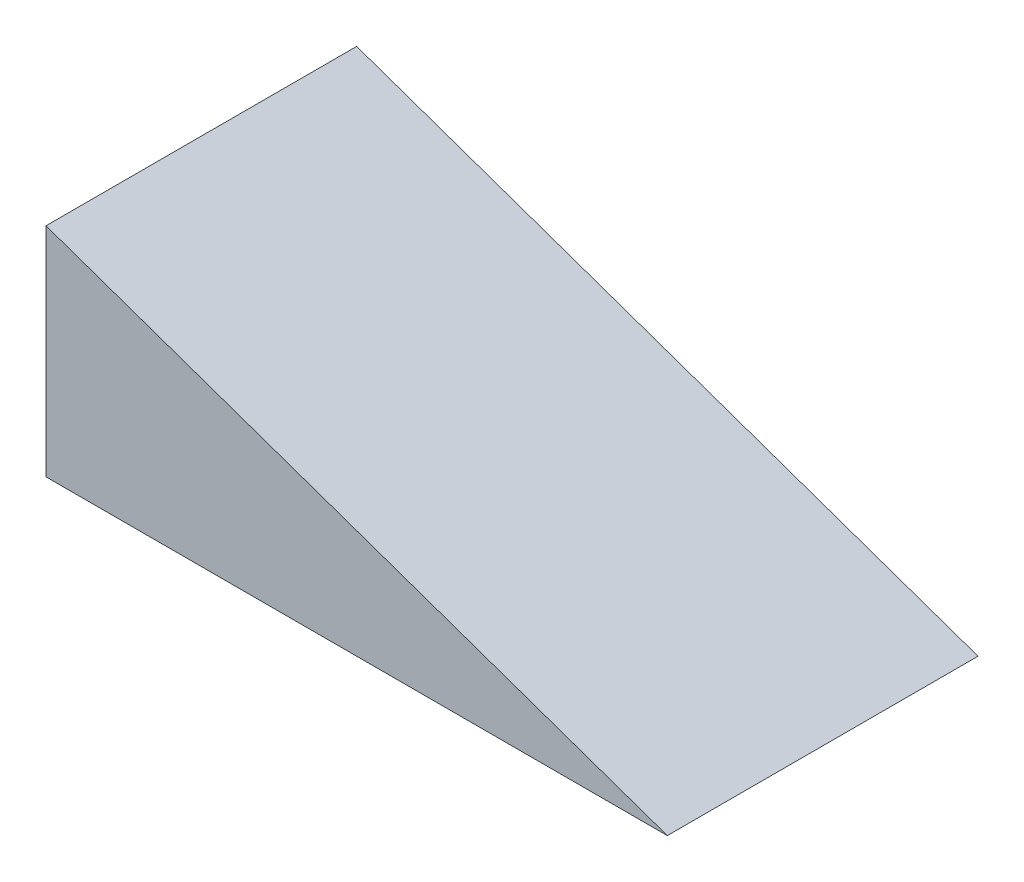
from build123d import *

# Parameters (mm, degrees)
AUFSATZ_LINEAR_AUSTRAGEN1_DEPTH = 100


with BuildPart() as part:
    # Skizze1 → Aufsatz-Linear austragen1 (new body)
    with BuildSketch(Plane.XY):
        Polygon((0, 70), (200, 0), (0, 0), align=None)
    extrude(amount=AUFSATZ_LINEAR_AUSTRAGEN1_DEPTH)


solid = part.part
